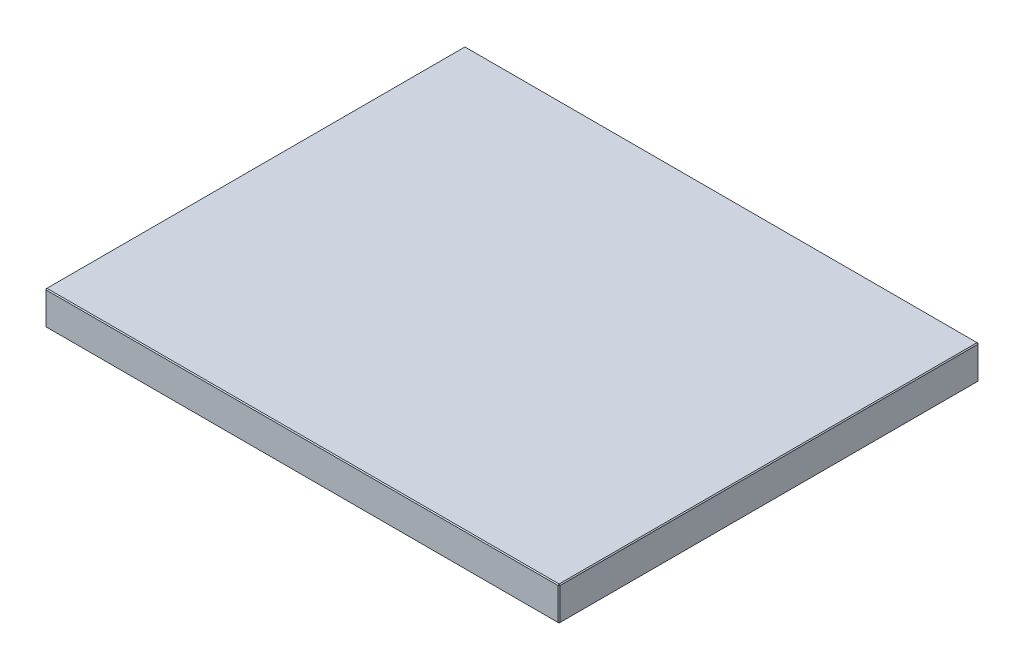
ISO-10303-21;
HEADER;
FILE_DESCRIPTION(('STEP AP214'),'2;1');
FILE_NAME('part.step','',(''),(''),'','','');
FILE_SCHEMA(('AUTOMOTIVE_DESIGN { 1 0 10303 214 1 1 1 1 }'));
ENDSEC;
DATA;
#1=APPLICATION_CONTEXT('core data for automotive mechanical design processes');
#2=APPLICATION_PROTOCOL_DEFINITION('international standard','automotive_design',2000,#1);
#3=PRODUCT_CONTEXT('',#1,'mechanical');
#4=PRODUCT('Part','Part','',(#3));
#5=PRODUCT_RELATED_PRODUCT_CATEGORY('part','',(#4));
#6=PRODUCT_DEFINITION_FORMATION('','',#4);
#7=PRODUCT_DEFINITION_CONTEXT('part definition',#1,'design');
#8=PRODUCT_DEFINITION('design','',#6,#7);
#9=PRODUCT_DEFINITION_SHAPE('','',#8);
#10=(LENGTH_UNIT() NAMED_UNIT(*) SI_UNIT(.MILLI.,.METRE.));
#11=(NAMED_UNIT(*) PLANE_ANGLE_UNIT() SI_UNIT($,.RADIAN.));
#12=(NAMED_UNIT(*) SI_UNIT($,.STERADIAN.) SOLID_ANGLE_UNIT());
#13=UNCERTAINTY_MEASURE_WITH_UNIT(LENGTH_MEASURE(1.E-05),#10,'distance_accuracy_value','');
#14=(GEOMETRIC_REPRESENTATION_CONTEXT(3) GLOBAL_UNCERTAINTY_ASSIGNED_CONTEXT((#13)) GLOBAL_UNIT_ASSIGNED_CONTEXT((#10,
#11,#12)) REPRESENTATION_CONTEXT('',''));
#15=CARTESIAN_POINT('',(0.,0.,0.));
#16=DIRECTION('',(0.,0.,1.));
#17=DIRECTION('',(1.,0.,0.));
#18=AXIS2_PLACEMENT_3D('',#15,#16,#17);
#19=CARTESIAN_POINT('',(-273.,36.,223.));
#20=DIRECTION('',(1.,0.,0.));
#21=DIRECTION('',(0.,0.,-1.));
#22=AXIS2_PLACEMENT_3D('',#19,#20,#21);
#23=PLANE('',#22);
#24=DIRECTION('',(0.,-1.,0.));
#25=VECTOR('',#24,1.);
#26=CARTESIAN_POINT('',(-273.,36.,-222.));
#27=LINE('',#26,#25);
#28=CARTESIAN_POINT('',(-273.,35.,-222.));
#29=VERTEX_POINT('',#28);
#30=CARTESIAN_POINT('',(-273.,1.00000000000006,-222.));
#31=VERTEX_POINT('',#30);
#32=EDGE_CURVE('E115',#29,#31,#27,.T.);
#33=ORIENTED_EDGE('',*,*,#32,.T.);
#34=DIRECTION('',(0.,0.,1.));
#35=VECTOR('',#34,1.);
#36=CARTESIAN_POINT('',(-273.,1.00000000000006,223.));
#37=LINE('',#36,#35);
#38=CARTESIAN_POINT('',(-273.,1.00000000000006,222.));
#39=VERTEX_POINT('',#38);
#40=EDGE_CURVE('E111',#31,#39,#37,.T.);
#41=ORIENTED_EDGE('',*,*,#40,.T.);
#42=DIRECTION('',(0.,1.,0.));
#43=VECTOR('',#42,1.);
#44=CARTESIAN_POINT('',(-273.,36.,222.));
#45=LINE('',#44,#43);
#46=CARTESIAN_POINT('',(-273.,35.,222.));
#47=VERTEX_POINT('',#46);
#48=EDGE_CURVE('E104',#39,#47,#45,.T.);
#49=ORIENTED_EDGE('',*,*,#48,.T.);
#50=DIRECTION('',(0.,0.,-1.));
#51=VECTOR('',#50,1.);
#52=CARTESIAN_POINT('',(-273.,35.,-223.));
#53=LINE('',#52,#51);
#54=EDGE_CURVE('E108',#47,#29,#53,.T.);
#55=ORIENTED_EDGE('',*,*,#54,.T.);
#56=EDGE_LOOP('',(#33,#41,#49,#55));
#57=FACE_BOUND('',#56,.T.);
#58=ADVANCED_FACE('F16',(#57),#23,.F.);
#59=CARTESIAN_POINT('',(273.,36.,223.));
#60=DIRECTION('',(0.,0.,-1.));
#61=DIRECTION('',(-1.,0.,0.));
#62=AXIS2_PLACEMENT_3D('',#59,#60,#61);
#63=PLANE('',#62);
#64=DIRECTION('',(-1.,0.,0.));
#65=VECTOR('',#64,1.);
#66=CARTESIAN_POINT('',(-273.,35.,223.));
#67=LINE('',#66,#65);
#68=CARTESIAN_POINT('',(272.,35.,223.));
#69=VERTEX_POINT('',#68);
#70=CARTESIAN_POINT('',(-272.,35.,223.));
#71=VERTEX_POINT('',#70);
#72=EDGE_CURVE('E165',#69,#71,#67,.T.);
#73=ORIENTED_EDGE('',*,*,#72,.T.);
#74=DIRECTION('',(0.,-1.,0.));
#75=VECTOR('',#74,1.);
#76=CARTESIAN_POINT('',(-272.,36.,223.));
#77=LINE('',#76,#75);
#78=CARTESIAN_POINT('',(-272.,1.00000000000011,223.));
#79=VERTEX_POINT('',#78);
#80=EDGE_CURVE('E123',#71,#79,#77,.T.);
#81=ORIENTED_EDGE('',*,*,#80,.T.);
#82=DIRECTION('',(1.,0.,0.));
#83=VECTOR('',#82,1.);
#84=CARTESIAN_POINT('',(273.,1.00000000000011,223.));
#85=LINE('',#84,#83);
#86=CARTESIAN_POINT('',(272.,1.00000000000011,223.));
#87=VERTEX_POINT('',#86);
#88=EDGE_CURVE('E169',#79,#87,#85,.T.);
#89=ORIENTED_EDGE('',*,*,#88,.T.);
#90=DIRECTION('',(0.,1.,0.));
#91=VECTOR('',#90,1.);
#92=CARTESIAN_POINT('',(272.,36.,223.));
#93=LINE('',#92,#91);
#94=EDGE_CURVE('E167',#87,#69,#93,.T.);
#95=ORIENTED_EDGE('',*,*,#94,.T.);
#96=EDGE_LOOP('',(#73,#81,#89,#95));
#97=FACE_BOUND('',#96,.T.);
#98=ADVANCED_FACE('F276',(#97),#63,.F.);
#99=CARTESIAN_POINT('',(273.,36.,223.));
#100=DIRECTION('',(-1.,0.,0.));
#101=DIRECTION('',(0.,0.,1.));
#102=AXIS2_PLACEMENT_3D('',#99,#100,#101);
#103=PLANE('',#102);
#104=DIRECTION('',(0.,0.,-1.));
#105=VECTOR('',#104,1.);
#106=CARTESIAN_POINT('',(273.,1.00000000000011,223.));
#107=LINE('',#106,#105);
#108=CARTESIAN_POINT('',(273.,1.00000000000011,222.));
#109=VERTEX_POINT('',#108);
#110=CARTESIAN_POINT('',(273.,1.00000000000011,-222.));
#111=VERTEX_POINT('',#110);
#112=EDGE_CURVE('E160',#109,#111,#107,.T.);
#113=ORIENTED_EDGE('',*,*,#112,.T.);
#114=DIRECTION('',(0.,1.,0.));
#115=VECTOR('',#114,1.);
#116=CARTESIAN_POINT('',(273.,36.,-222.));
#117=LINE('',#116,#115);
#118=CARTESIAN_POINT('',(273.,35.,-222.));
#119=VERTEX_POINT('',#118);
#120=EDGE_CURVE('E162',#111,#119,#117,.T.);
#121=ORIENTED_EDGE('',*,*,#120,.T.);
#122=DIRECTION('',(0.,0.,1.));
#123=VECTOR('',#122,1.);
#124=CARTESIAN_POINT('',(273.,35.,223.));
#125=LINE('',#124,#123);
#126=CARTESIAN_POINT('',(273.,35.,222.));
#127=VERTEX_POINT('',#126);
#128=EDGE_CURVE('E156',#119,#127,#125,.T.);
#129=ORIENTED_EDGE('',*,*,#128,.T.);
#130=DIRECTION('',(0.,-1.,0.));
#131=VECTOR('',#130,1.);
#132=CARTESIAN_POINT('',(273.,36.,222.));
#133=LINE('',#132,#131);
#134=EDGE_CURVE('E158',#127,#109,#133,.T.);
#135=ORIENTED_EDGE('',*,*,#134,.T.);
#136=EDGE_LOOP('',(#113,#121,#129,#135));
#137=FACE_BOUND('',#136,.T.);
#138=ADVANCED_FACE('F255',(#137),#103,.F.);
#139=CARTESIAN_POINT('',(273.,36.,-223.));
#140=DIRECTION('',(0.,0.,1.));
#141=DIRECTION('',(1.,0.,0.));
#142=AXIS2_PLACEMENT_3D('',#139,#140,#141);
#143=PLANE('',#142);
#144=DIRECTION('',(0.,-1.,0.));
#145=VECTOR('',#144,1.);
#146=CARTESIAN_POINT('',(272.,36.,-223.));
#147=LINE('',#146,#145);
#148=CARTESIAN_POINT('',(272.,35.,-223.));
#149=VERTEX_POINT('',#148);
#150=CARTESIAN_POINT('',(272.,1.00000000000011,-223.));
#151=VERTEX_POINT('',#150);
#152=EDGE_CURVE('E149',#149,#151,#147,.T.);
#153=ORIENTED_EDGE('',*,*,#152,.T.);
#154=DIRECTION('',(-1.,0.,0.));
#155=VECTOR('',#154,1.);
#156=CARTESIAN_POINT('',(273.,1.00000000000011,-223.));
#157=LINE('',#156,#155);
#158=CARTESIAN_POINT('',(-272.,1.00000000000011,-223.));
#159=VERTEX_POINT('',#158);
#160=EDGE_CURVE('E154',#151,#159,#157,.T.);
#161=ORIENTED_EDGE('',*,*,#160,.T.);
#162=DIRECTION('',(0.,1.,0.));
#163=VECTOR('',#162,1.);
#164=CARTESIAN_POINT('',(-272.,36.,-223.));
#165=LINE('',#164,#163);
#166=CARTESIAN_POINT('',(-272.,35.,-223.));
#167=VERTEX_POINT('',#166);
#168=EDGE_CURVE('E151',#159,#167,#165,.T.);
#169=ORIENTED_EDGE('',*,*,#168,.T.);
#170=DIRECTION('',(1.,0.,0.));
#171=VECTOR('',#170,1.);
#172=CARTESIAN_POINT('',(273.,35.,-223.));
#173=LINE('',#172,#171);
#174=EDGE_CURVE('E147',#167,#149,#173,.T.);
#175=ORIENTED_EDGE('',*,*,#174,.T.);
#176=EDGE_LOOP('',(#153,#161,#169,#175));
#177=FACE_BOUND('',#176,.T.);
#178=ADVANCED_FACE('F285',(#177),#143,.F.);
#179=CARTESIAN_POINT('',(0.,36.,0.));
#180=DIRECTION('',(0.,1.,0.));
#181=DIRECTION('',(0.,0.,1.));
#182=AXIS2_PLACEMENT_3D('',#179,#180,#181);
#183=PLANE('',#182);
#184=DIRECTION('',(0.,0.,-1.));
#185=VECTOR('',#184,1.);
#186=CARTESIAN_POINT('',(272.,36.,-223.));
#187=LINE('',#186,#185);
#188=CARTESIAN_POINT('',(272.,36.,222.));
#189=VERTEX_POINT('',#188);
#190=CARTESIAN_POINT('',(272.,36.,-222.));
#191=VERTEX_POINT('',#190);
#192=EDGE_CURVE('E25',#189,#191,#187,.T.);
#193=ORIENTED_EDGE('',*,*,#192,.T.);
#194=DIRECTION('',(-1.,0.,0.));
#195=VECTOR('',#194,1.);
#196=CARTESIAN_POINT('',(-273.,36.,-222.));
#197=LINE('',#196,#195);
#198=CARTESIAN_POINT('',(-272.,36.,-222.));
#199=VERTEX_POINT('',#198);
#200=EDGE_CURVE('E10',#191,#199,#197,.T.);
#201=ORIENTED_EDGE('',*,*,#200,.T.);
#202=DIRECTION('',(0.,0.,1.));
#203=VECTOR('',#202,1.);
#204=CARTESIAN_POINT('',(-272.,36.,223.));
#205=LINE('',#204,#203);
#206=CARTESIAN_POINT('',(-272.,36.,222.));
#207=VERTEX_POINT('',#206);
#208=EDGE_CURVE('E181',#199,#207,#205,.T.);
#209=ORIENTED_EDGE('',*,*,#208,.T.);
#210=DIRECTION('',(1.,0.,0.));
#211=VECTOR('',#210,1.);
#212=CARTESIAN_POINT('',(273.,36.,222.));
#213=LINE('',#212,#211);
#214=EDGE_CURVE('E36',#207,#189,#213,.T.);
#215=ORIENTED_EDGE('',*,*,#214,.T.);
#216=EDGE_LOOP('',(#193,#201,#209,#215));
#217=FACE_BOUND('',#216,.T.);
#218=ADVANCED_FACE('F351',(#217),#183,.T.);
#219=CARTESIAN_POINT('',(0.,0.,0.));
#220=DIRECTION('',(0.,1.,0.));
#221=DIRECTION('',(0.,0.,1.));
#222=AXIS2_PLACEMENT_3D('',#219,#220,#221);
#223=PLANE('',#222);
#224=DIRECTION('',(0.,0.,1.));
#225=VECTOR('',#224,1.);
#226=CARTESIAN_POINT('',(272.,0.,0.));
#227=LINE('',#226,#225);
#228=CARTESIAN_POINT('',(272.,0.,-222.));
#229=VERTEX_POINT('',#228);
#230=CARTESIAN_POINT('',(272.,0.,222.));
#231=VERTEX_POINT('',#230);
#232=EDGE_CURVE('E172',#229,#231,#227,.T.);
#233=ORIENTED_EDGE('',*,*,#232,.T.);
#234=DIRECTION('',(-1.,0.,0.));
#235=VECTOR('',#234,1.);
#236=CARTESIAN_POINT('',(0.,0.,222.));
#237=LINE('',#236,#235);
#238=CARTESIAN_POINT('',(-272.,0.,222.));
#239=VERTEX_POINT('',#238);
#240=EDGE_CURVE('E178',#231,#239,#237,.T.);
#241=ORIENTED_EDGE('',*,*,#240,.T.);
#242=DIRECTION('',(0.,0.,-1.));
#243=VECTOR('',#242,1.);
#244=CARTESIAN_POINT('',(-272.,0.,0.));
#245=LINE('',#244,#243);
#246=CARTESIAN_POINT('',(-272.,0.,-222.));
#247=VERTEX_POINT('',#246);
#248=EDGE_CURVE('E176',#239,#247,#245,.T.);
#249=ORIENTED_EDGE('',*,*,#248,.T.);
#250=DIRECTION('',(1.,0.,0.));
#251=VECTOR('',#250,1.);
#252=CARTESIAN_POINT('',(0.,0.,-222.));
#253=LINE('',#252,#251);
#254=EDGE_CURVE('E174',#247,#229,#253,.T.);
#255=ORIENTED_EDGE('',*,*,#254,.T.);
#256=EDGE_LOOP('',(#233,#241,#249,#255));
#257=FACE_BOUND('',#256,.T.);
#258=ADVANCED_FACE('F247',(#257),#223,.F.);
#259=CARTESIAN_POINT('',(273.,36.,222.));
#260=DIRECTION('',(-0.707106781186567,0.,-0.707106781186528));
#261=DIRECTION('',(0.,-1.,0.));
#262=AXIS2_PLACEMENT_3D('',#259,#260,#261);
#263=PLANE('',#262);
#264=DIRECTION('',(-0.707106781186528,0.,0.707106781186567));
#265=VECTOR('',#264,1.);
#266=CARTESIAN_POINT('',(272.,35.,223.));
#267=LINE('',#266,#265);
#268=EDGE_CURVE('E20',#69,#127,#267,.F.);
#269=ORIENTED_EDGE('',*,*,#268,.F.);
#270=ORIENTED_EDGE('',*,*,#94,.F.);
#271=DIRECTION('',(0.707106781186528,0.,-0.707106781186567));
#272=VECTOR('',#271,1.);
#273=CARTESIAN_POINT('',(272.,1.00000000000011,223.));
#274=LINE('',#273,#272);
#275=EDGE_CURVE('E143',#109,#87,#274,.F.);
#276=ORIENTED_EDGE('',*,*,#275,.F.);
#277=ORIENTED_EDGE('',*,*,#134,.F.);
#278=EDGE_LOOP('',(#269,#270,#276,#277));
#279=FACE_BOUND('',#278,.T.);
#280=ADVANCED_FACE('F18',(#279),#263,.F.);
#281=CARTESIAN_POINT('',(272.,35.,223.));
#282=DIRECTION('',(0.577350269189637,0.577350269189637,0.577350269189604));
#283=DIRECTION('',(-0.707106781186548,0.707106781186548,0.));
#284=AXIS2_PLACEMENT_3D('',#281,#282,#283);
#285=PLANE('',#284);
#286=DIRECTION('',(0.,-0.707106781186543,0.707106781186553));
#287=VECTOR('',#286,1.);
#288=CARTESIAN_POINT('',(272.,35.,223.));
#289=LINE('',#288,#287);
#290=EDGE_CURVE('E227',#69,#189,#289,.F.);
#291=ORIENTED_EDGE('',*,*,#290,.F.);
#292=ORIENTED_EDGE('',*,*,#268,.T.);
#293=DIRECTION('',(-0.707106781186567,0.707106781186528,0.));
#294=VECTOR('',#293,1.);
#295=CARTESIAN_POINT('',(272.5,35.5,222.));
#296=LINE('',#295,#294);
#297=EDGE_CURVE('E229',#189,#127,#296,.F.);
#298=ORIENTED_EDGE('',*,*,#297,.F.);
#299=EDGE_LOOP('',(#291,#292,#298));
#300=FACE_BOUND('',#299,.T.);
#301=ADVANCED_FACE('F271',(#300),#285,.T.);
#302=CARTESIAN_POINT('',(272.,1.00000000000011,223.));
#303=DIRECTION('',(0.577350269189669,-0.577350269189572,0.577350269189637));
#304=DIRECTION('',(0.707106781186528,0.,-0.707106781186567));
#305=AXIS2_PLACEMENT_3D('',#302,#303,#304);
#306=PLANE('',#305);
#307=DIRECTION('',(-0.707106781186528,-0.707106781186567,0.));
#308=VECTOR('',#307,1.);
#309=CARTESIAN_POINT('',(272.5,0.500000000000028,222.));
#310=LINE('',#309,#308);
#311=EDGE_CURVE('E221',#109,#231,#310,.T.);
#312=ORIENTED_EDGE('',*,*,#311,.F.);
#313=ORIENTED_EDGE('',*,*,#275,.T.);
#314=DIRECTION('',(0.,0.707106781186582,0.707106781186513));
#315=VECTOR('',#314,1.);
#316=CARTESIAN_POINT('',(272.,1.00000000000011,223.));
#317=LINE('',#316,#315);
#318=EDGE_CURVE('E224',#231,#87,#317,.T.);
#319=ORIENTED_EDGE('',*,*,#318,.F.);
#320=EDGE_LOOP('',(#312,#313,#319));
#321=FACE_BOUND('',#320,.T.);
#322=ADVANCED_FACE('F236',(#321),#306,.T.);
#323=CARTESIAN_POINT('',(272.,36.,0.));
#324=DIRECTION('',(0.707106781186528,0.707106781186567,0.));
#325=DIRECTION('',(0.,0.,1.));
#326=AXIS2_PLACEMENT_3D('',#323,#324,#325);
#327=PLANE('',#326);
#328=ORIENTED_EDGE('',*,*,#297,.T.);
#329=ORIENTED_EDGE('',*,*,#128,.F.);
#330=DIRECTION('',(0.707106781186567,-0.707106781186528,0.));
#331=VECTOR('',#330,1.);
#332=CARTESIAN_POINT('',(273.,35.,-222.));
#333=LINE('',#332,#331);
#334=EDGE_CURVE('E216',#191,#119,#333,.T.);
#335=ORIENTED_EDGE('',*,*,#334,.F.);
#336=ORIENTED_EDGE('',*,*,#192,.F.);
#337=EDGE_LOOP('',(#328,#329,#335,#336));
#338=FACE_BOUND('',#337,.T.);
#339=ADVANCED_FACE('F266',(#338),#327,.T.);
#340=CARTESIAN_POINT('',(0.,36.,222.));
#341=DIRECTION('',(0.,0.707106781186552,0.707106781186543));
#342=DIRECTION('',(-1.,0.,0.));
#343=AXIS2_PLACEMENT_3D('',#340,#341,#342);
#344=PLANE('',#343);
#345=ORIENTED_EDGE('',*,*,#290,.T.);
#346=ORIENTED_EDGE('',*,*,#214,.F.);
#347=DIRECTION('',(0.,0.707106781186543,-0.707106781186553));
#348=VECTOR('',#347,1.);
#349=CARTESIAN_POINT('',(-272.,35.5,222.5));
#350=LINE('',#349,#348);
#351=EDGE_CURVE('E127',#71,#207,#350,.T.);
#352=ORIENTED_EDGE('',*,*,#351,.F.);
#353=ORIENTED_EDGE('',*,*,#72,.F.);
#354=EDGE_LOOP('',(#345,#346,#352,#353));
#355=FACE_BOUND('',#354,.T.);
#356=ADVANCED_FACE('F274',(#355),#344,.T.);
#357=CARTESIAN_POINT('',(-272.,36.,223.));
#358=DIRECTION('',(0.707106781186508,0.,-0.707106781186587));
#359=DIRECTION('',(0.,-1.,0.));
#360=AXIS2_PLACEMENT_3D('',#357,#358,#359);
#361=PLANE('',#360);
#362=DIRECTION('',(0.707106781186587,0.,0.707106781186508));
#363=VECTOR('',#362,1.);
#364=CARTESIAN_POINT('',(-272.,1.00000000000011,223.));
#365=LINE('',#364,#363);
#366=EDGE_CURVE('E128',#79,#39,#365,.F.);
#367=ORIENTED_EDGE('',*,*,#366,.F.);
#368=ORIENTED_EDGE('',*,*,#80,.F.);
#369=DIRECTION('',(-0.707106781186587,0.,-0.707106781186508));
#370=VECTOR('',#369,1.);
#371=CARTESIAN_POINT('',(-273.,35.,222.));
#372=LINE('',#371,#370);
#373=EDGE_CURVE('E119',#47,#71,#372,.F.);
#374=ORIENTED_EDGE('',*,*,#373,.F.);
#375=ORIENTED_EDGE('',*,*,#48,.F.);
#376=EDGE_LOOP('',(#367,#368,#374,#375));
#377=FACE_BOUND('',#376,.T.);
#378=ADVANCED_FACE('F121',(#377),#361,.F.);
#379=CARTESIAN_POINT('',(273.,1.00000000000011,223.));
#380=DIRECTION('',(0.,0.707106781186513,-0.707106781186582));
#381=DIRECTION('',(1.,0.,0.));
#382=AXIS2_PLACEMENT_3D('',#379,#380,#381);
#383=PLANE('',#382);
#384=ORIENTED_EDGE('',*,*,#318,.T.);
#385=ORIENTED_EDGE('',*,*,#88,.F.);
#386=DIRECTION('',(0.,-0.707106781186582,-0.707106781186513));
#387=VECTOR('',#386,1.);
#388=CARTESIAN_POINT('',(-272.,1.00000000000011,223.));
#389=LINE('',#388,#387);
#390=EDGE_CURVE('E212',#239,#79,#389,.F.);
#391=ORIENTED_EDGE('',*,*,#390,.F.);
#392=ORIENTED_EDGE('',*,*,#240,.F.);
#393=EDGE_LOOP('',(#384,#385,#391,#392));
#394=FACE_BOUND('',#393,.T.);
#395=ADVANCED_FACE('F244',(#394),#383,.F.);
#396=CARTESIAN_POINT('',(273.,1.00000000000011,223.));
#397=DIRECTION('',(-0.707106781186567,0.707106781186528,0.));
#398=DIRECTION('',(0.,0.,-1.));
#399=AXIS2_PLACEMENT_3D('',#396,#397,#398);
#400=PLANE('',#399);
#401=ORIENTED_EDGE('',*,*,#311,.T.);
#402=ORIENTED_EDGE('',*,*,#232,.F.);
#403=DIRECTION('',(0.707106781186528,0.707106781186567,0.));
#404=VECTOR('',#403,1.);
#405=CARTESIAN_POINT('',(272.5,0.500000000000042,-222.));
#406=LINE('',#405,#404);
#407=EDGE_CURVE('E209',#111,#229,#406,.F.);
#408=ORIENTED_EDGE('',*,*,#407,.F.);
#409=ORIENTED_EDGE('',*,*,#112,.F.);
#410=EDGE_LOOP('',(#401,#402,#408,#409));
#411=FACE_BOUND('',#410,.T.);
#412=ADVANCED_FACE('F252',(#411),#400,.F.);
#413=CARTESIAN_POINT('',(272.,36.,-223.));
#414=DIRECTION('',(-0.707106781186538,0.,0.707106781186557));
#415=DIRECTION('',(0.,-1.,0.));
#416=AXIS2_PLACEMENT_3D('',#413,#414,#415);
#417=PLANE('',#416);
#418=DIRECTION('',(0.707106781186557,0.,0.707106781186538));
#419=VECTOR('',#418,1.);
#420=CARTESIAN_POINT('',(273.,35.,-222.));
#421=LINE('',#420,#419);
#422=EDGE_CURVE('E218',#119,#149,#421,.F.);
#423=ORIENTED_EDGE('',*,*,#422,.F.);
#424=ORIENTED_EDGE('',*,*,#120,.F.);
#425=DIRECTION('',(-0.707106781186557,0.,-0.707106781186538));
#426=VECTOR('',#425,1.);
#427=CARTESIAN_POINT('',(272.,1.00000000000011,-223.));
#428=LINE('',#427,#426);
#429=EDGE_CURVE('E206',#151,#111,#428,.F.);
#430=ORIENTED_EDGE('',*,*,#429,.F.);
#431=ORIENTED_EDGE('',*,*,#152,.F.);
#432=EDGE_LOOP('',(#423,#424,#430,#431));
#433=FACE_BOUND('',#432,.T.);
#434=ADVANCED_FACE('F259',(#433),#417,.F.);
#435=CARTESIAN_POINT('',(273.,35.,-222.));
#436=DIRECTION('',(0.577350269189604,0.577350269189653,-0.57735026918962));
#437=DIRECTION('',(0.,0.707106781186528,0.707106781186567));
#438=AXIS2_PLACEMENT_3D('',#435,#436,#437);
#439=PLANE('',#438);
#440=ORIENTED_EDGE('',*,*,#334,.T.);
#441=ORIENTED_EDGE('',*,*,#422,.T.);
#442=DIRECTION('',(0.,0.707106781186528,0.707106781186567));
#443=VECTOR('',#442,1.);
#444=CARTESIAN_POINT('',(272.,35.5,-222.5));
#445=LINE('',#444,#443);
#446=EDGE_CURVE('E135',#191,#149,#445,.F.);
#447=ORIENTED_EDGE('',*,*,#446,.F.);
#448=EDGE_LOOP('',(#440,#441,#447));
#449=FACE_BOUND('',#448,.T.);
#450=ADVANCED_FACE('F326',(#449),#439,.T.);
#451=CARTESIAN_POINT('',(-273.,35.,222.));
#452=DIRECTION('',(-0.577350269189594,0.577350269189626,0.577350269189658));
#453=DIRECTION('',(0.,-0.707106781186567,0.707106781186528));
#454=AXIS2_PLACEMENT_3D('',#451,#452,#453);
#455=PLANE('',#454);
#456=ORIENTED_EDGE('',*,*,#373,.T.);
#457=ORIENTED_EDGE('',*,*,#351,.T.);
#458=DIRECTION('',(-0.707106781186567,-0.707106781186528,0.));
#459=VECTOR('',#458,1.);
#460=CARTESIAN_POINT('',(-273.,35.,222.));
#461=LINE('',#460,#459);
#462=EDGE_CURVE('E131',#47,#207,#461,.F.);
#463=ORIENTED_EDGE('',*,*,#462,.F.);
#464=EDGE_LOOP('',(#456,#457,#463));
#465=FACE_BOUND('',#464,.T.);
#466=ADVANCED_FACE('F132',(#465),#455,.T.);
#467=CARTESIAN_POINT('',(-272.,1.00000000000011,223.));
#468=DIRECTION('',(-0.577350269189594,-0.577350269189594,0.57735026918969));
#469=DIRECTION('',(0.707106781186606,0.,0.707106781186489));
#470=AXIS2_PLACEMENT_3D('',#467,#468,#469);
#471=PLANE('',#470);
#472=ORIENTED_EDGE('',*,*,#390,.T.);
#473=ORIENTED_EDGE('',*,*,#366,.T.);
#474=DIRECTION('',(-0.707106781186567,0.707106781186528,0.));
#475=VECTOR('',#474,1.);
#476=CARTESIAN_POINT('',(-272.5,0.499999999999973,222.));
#477=LINE('',#476,#475);
#478=EDGE_CURVE('E136',#239,#39,#477,.T.);
#479=ORIENTED_EDGE('',*,*,#478,.F.);
#480=EDGE_LOOP('',(#472,#473,#479));
#481=FACE_BOUND('',#480,.T.);
#482=ADVANCED_FACE('F319',(#481),#471,.T.);
#483=CARTESIAN_POINT('',(272.,1.00000000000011,-223.));
#484=DIRECTION('',(0.577350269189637,-0.577350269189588,-0.577350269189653));
#485=DIRECTION('',(-0.707106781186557,0.,-0.707106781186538));
#486=AXIS2_PLACEMENT_3D('',#483,#484,#485);
#487=PLANE('',#486);
#488=ORIENTED_EDGE('',*,*,#429,.T.);
#489=ORIENTED_EDGE('',*,*,#407,.T.);
#490=DIRECTION('',(0.,-0.707106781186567,0.707106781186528));
#491=VECTOR('',#490,1.);
#492=CARTESIAN_POINT('',(272.,1.00000000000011,-223.));
#493=LINE('',#492,#491);
#494=EDGE_CURVE('E199',#151,#229,#493,.T.);
#495=ORIENTED_EDGE('',*,*,#494,.F.);
#496=EDGE_LOOP('',(#488,#489,#495));
#497=FACE_BOUND('',#496,.T.);
#498=ADVANCED_FACE('F315',(#497),#487,.T.);
#499=CARTESIAN_POINT('',(0.,36.,-222.));
#500=DIRECTION('',(0.,0.707106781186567,-0.707106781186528));
#501=DIRECTION('',(1.,0.,0.));
#502=AXIS2_PLACEMENT_3D('',#499,#500,#501);
#503=PLANE('',#502);
#504=ORIENTED_EDGE('',*,*,#446,.T.);
#505=ORIENTED_EDGE('',*,*,#174,.F.);
#506=DIRECTION('',(0.,-0.707106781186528,-0.707106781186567));
#507=VECTOR('',#506,1.);
#508=CARTESIAN_POINT('',(-272.,35.,-223.));
#509=LINE('',#508,#507);
#510=EDGE_CURVE('E196',#199,#167,#509,.T.);
#511=ORIENTED_EDGE('',*,*,#510,.F.);
#512=ORIENTED_EDGE('',*,*,#200,.F.);
#513=EDGE_LOOP('',(#504,#505,#511,#512));
#514=FACE_BOUND('',#513,.T.);
#515=ADVANCED_FACE('F312',(#514),#503,.T.);
#516=CARTESIAN_POINT('',(-272.,36.,0.));
#517=DIRECTION('',(-0.707106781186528,0.707106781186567,0.));
#518=DIRECTION('',(0.,0.,-1.));
#519=AXIS2_PLACEMENT_3D('',#516,#517,#518);
#520=PLANE('',#519);
#521=ORIENTED_EDGE('',*,*,#462,.T.);
#522=ORIENTED_EDGE('',*,*,#208,.F.);
#523=DIRECTION('',(0.707106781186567,0.707106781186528,0.));
#524=VECTOR('',#523,1.);
#525=CARTESIAN_POINT('',(-272.5,35.5,-222.));
#526=LINE('',#525,#524);
#527=EDGE_CURVE('E139',#29,#199,#526,.T.);
#528=ORIENTED_EDGE('',*,*,#527,.F.);
#529=ORIENTED_EDGE('',*,*,#54,.F.);
#530=EDGE_LOOP('',(#521,#522,#528,#529));
#531=FACE_BOUND('',#530,.T.);
#532=ADVANCED_FACE('F138',(#531),#520,.T.);
#533=CARTESIAN_POINT('',(-273.,1.00000000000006,223.));
#534=DIRECTION('',(0.707106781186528,0.707106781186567,0.));
#535=DIRECTION('',(0.,0.,1.));
#536=AXIS2_PLACEMENT_3D('',#533,#534,#535);
#537=PLANE('',#536);
#538=ORIENTED_EDGE('',*,*,#478,.T.);
#539=ORIENTED_EDGE('',*,*,#40,.F.);
#540=DIRECTION('',(0.707106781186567,-0.707106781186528,0.));
#541=VECTOR('',#540,1.);
#542=CARTESIAN_POINT('',(-273.,1.00000000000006,-222.));
#543=LINE('',#542,#541);
#544=EDGE_CURVE('E192',#247,#31,#543,.F.);
#545=ORIENTED_EDGE('',*,*,#544,.F.);
#546=ORIENTED_EDGE('',*,*,#248,.F.);
#547=EDGE_LOOP('',(#538,#539,#545,#546));
#548=FACE_BOUND('',#547,.T.);
#549=ADVANCED_FACE('F305',(#548),#537,.F.);
#550=CARTESIAN_POINT('',(273.,1.00000000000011,-223.));
#551=DIRECTION('',(0.,0.707106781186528,0.707106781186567));
#552=DIRECTION('',(-1.,0.,0.));
#553=AXIS2_PLACEMENT_3D('',#550,#551,#552);
#554=PLANE('',#553);
#555=ORIENTED_EDGE('',*,*,#494,.T.);
#556=ORIENTED_EDGE('',*,*,#254,.F.);
#557=DIRECTION('',(0.,0.707106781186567,-0.707106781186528));
#558=VECTOR('',#557,1.);
#559=CARTESIAN_POINT('',(-272.,0.500000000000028,-222.5));
#560=LINE('',#559,#558);
#561=EDGE_CURVE('E189',#159,#247,#560,.F.);
#562=ORIENTED_EDGE('',*,*,#561,.F.);
#563=ORIENTED_EDGE('',*,*,#160,.F.);
#564=EDGE_LOOP('',(#555,#556,#562,#563));
#565=FACE_BOUND('',#564,.T.);
#566=ADVANCED_FACE('F301',(#565),#554,.F.);
#567=CARTESIAN_POINT('',(-272.,35.,-223.));
#568=DIRECTION('',(-0.577350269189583,0.577350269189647,-0.577350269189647));
#569=DIRECTION('',(0.,0.707106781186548,0.707106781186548));
#570=AXIS2_PLACEMENT_3D('',#567,#568,#569);
#571=PLANE('',#570);
#572=ORIENTED_EDGE('',*,*,#527,.T.);
#573=ORIENTED_EDGE('',*,*,#510,.T.);
#574=DIRECTION('',(0.707106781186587,0.,-0.707106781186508));
#575=VECTOR('',#574,1.);
#576=CARTESIAN_POINT('',(-272.,35.,-223.));
#577=LINE('',#576,#575);
#578=EDGE_CURVE('E187',#29,#167,#577,.T.);
#579=ORIENTED_EDGE('',*,*,#578,.F.);
#580=EDGE_LOOP('',(#572,#573,#579));
#581=FACE_BOUND('',#580,.T.);
#582=ADVANCED_FACE('F297',(#581),#571,.T.);
#583=CARTESIAN_POINT('',(-273.,1.00000000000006,-222.));
#584=DIRECTION('',(-0.577350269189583,-0.577350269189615,-0.577350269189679));
#585=DIRECTION('',(0.,0.707106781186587,-0.707106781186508));
#586=AXIS2_PLACEMENT_3D('',#583,#584,#585);
#587=PLANE('',#586);
#588=ORIENTED_EDGE('',*,*,#561,.T.);
#589=ORIENTED_EDGE('',*,*,#544,.T.);
#590=DIRECTION('',(-0.707106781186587,0.,0.707106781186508));
#591=VECTOR('',#590,1.);
#592=CARTESIAN_POINT('',(-273.,1.00000000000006,-222.));
#593=LINE('',#592,#591);
#594=EDGE_CURVE('E185',#159,#31,#593,.T.);
#595=ORIENTED_EDGE('',*,*,#594,.F.);
#596=EDGE_LOOP('',(#588,#589,#595));
#597=FACE_BOUND('',#596,.T.);
#598=ADVANCED_FACE('F293',(#597),#587,.T.);
#599=CARTESIAN_POINT('',(-273.,36.,-222.));
#600=DIRECTION('',(0.707106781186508,0.,0.707106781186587));
#601=DIRECTION('',(0.,-1.,0.));
#602=AXIS2_PLACEMENT_3D('',#599,#600,#601);
#603=PLANE('',#602);
#604=ORIENTED_EDGE('',*,*,#578,.T.);
#605=ORIENTED_EDGE('',*,*,#168,.F.);
#606=ORIENTED_EDGE('',*,*,#594,.T.);
#607=ORIENTED_EDGE('',*,*,#32,.F.);
#608=EDGE_LOOP('',(#604,#605,#606,#607));
#609=FACE_BOUND('',#608,.T.);
#610=ADVANCED_FACE('F290',(#609),#603,.F.);
#611=CLOSED_SHELL('',(#58,#98,#138,#178,#218,#258,#280,#301,#322,#339,#356,#378,#395,#412,#434,
#450,#466,#482,#498,#515,#532,#549,#566,#582,#598,#610));
#612=MANIFOLD_SOLID_BREP('B1',#611);
#613=ADVANCED_BREP_SHAPE_REPRESENTATION('',(#18,#612),#14);
#614=SHAPE_DEFINITION_REPRESENTATION(#9,#613);
ENDSEC;
END-ISO-10303-21;
